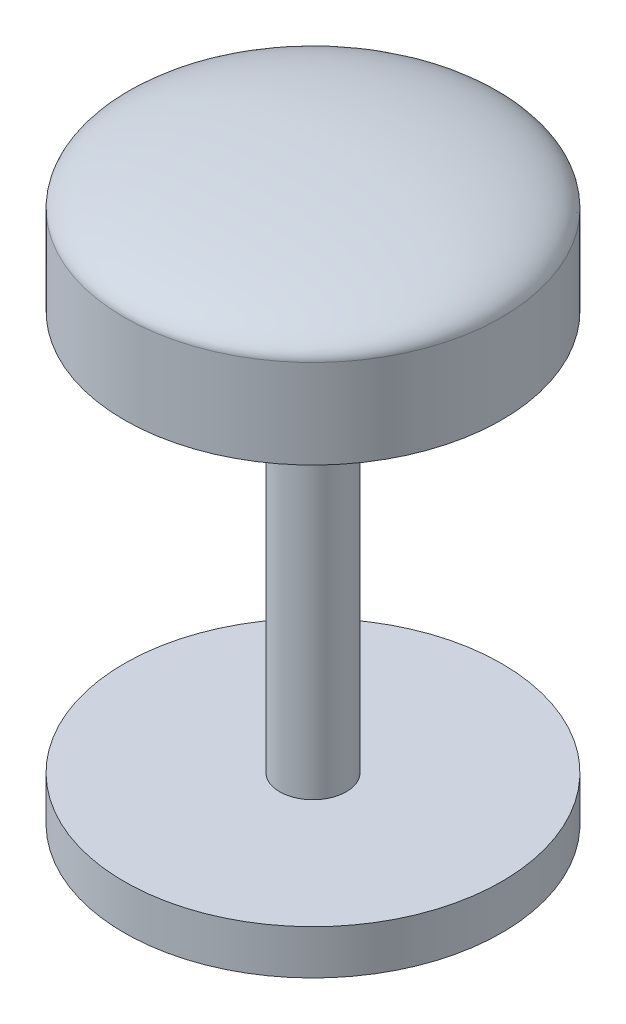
ISO-10303-21;
HEADER;
FILE_DESCRIPTION(('STEP AP214'),'2;1');
FILE_NAME('part.step','',(''),(''),'','','');
FILE_SCHEMA(('AUTOMOTIVE_DESIGN { 1 0 10303 214 1 1 1 1 }'));
ENDSEC;
DATA;
#1=APPLICATION_CONTEXT('core data for automotive mechanical design processes');
#2=APPLICATION_PROTOCOL_DEFINITION('international standard','automotive_design',2000,#1);
#3=PRODUCT_CONTEXT('',#1,'mechanical');
#4=PRODUCT('Part','Part','',(#3));
#5=PRODUCT_RELATED_PRODUCT_CATEGORY('part','',(#4));
#6=PRODUCT_DEFINITION_FORMATION('','',#4);
#7=PRODUCT_DEFINITION_CONTEXT('part definition',#1,'design');
#8=PRODUCT_DEFINITION('design','',#6,#7);
#9=PRODUCT_DEFINITION_SHAPE('','',#8);
#10=(LENGTH_UNIT() NAMED_UNIT(*) SI_UNIT(.MILLI.,.METRE.));
#11=(NAMED_UNIT(*) PLANE_ANGLE_UNIT() SI_UNIT($,.RADIAN.));
#12=(NAMED_UNIT(*) SI_UNIT($,.STERADIAN.) SOLID_ANGLE_UNIT());
#13=UNCERTAINTY_MEASURE_WITH_UNIT(LENGTH_MEASURE(1.E-05),#10,'distance_accuracy_value','');
#14=(GEOMETRIC_REPRESENTATION_CONTEXT(3) GLOBAL_UNCERTAINTY_ASSIGNED_CONTEXT((#13)) GLOBAL_UNIT_ASSIGNED_CONTEXT((#10,
#11,#12)) REPRESENTATION_CONTEXT('',''));
#15=CARTESIAN_POINT('',(0.,0.,0.));
#16=DIRECTION('',(0.,0.,1.));
#17=DIRECTION('',(1.,0.,0.));
#18=AXIS2_PLACEMENT_3D('',#15,#16,#17);
#19=CARTESIAN_POINT('',(0.,-4.24264068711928,0.));
#20=DIRECTION('',(0.,1.,0.));
#21=DIRECTION('',(0.,0.,1.));
#22=AXIS2_PLACEMENT_3D('',#19,#20,#21);
#23=CYLINDRICAL_SURFACE('',#22,1.5);
#24=CARTESIAN_POINT('',(0.,20.,0.));
#25=DIRECTION('',(0.,1.,0.));
#26=DIRECTION('',(0.,0.,1.));
#27=AXIS2_PLACEMENT_3D('',#24,#25,#26);
#28=CIRCLE('',#27,1.5);
#29=CARTESIAN_POINT('',(0.,20.,1.5));
#30=VERTEX_POINT('',#29);
#31=EDGE_CURVE('E64',#30,#30,#28,.T.);
#32=ORIENTED_EDGE('',*,*,#31,.F.);
#33=EDGE_LOOP('',(#32));
#34=FACE_BOUND('',#33,.T.);
#35=CARTESIAN_POINT('',(0.,2.,0.));
#36=DIRECTION('',(0.,-1.,0.));
#37=DIRECTION('',(0.,0.,-1.));
#38=AXIS2_PLACEMENT_3D('',#35,#36,#37);
#39=CIRCLE('',#38,1.5);
#40=CARTESIAN_POINT('',(0.,2.,-1.5));
#41=VERTEX_POINT('',#40);
#42=EDGE_CURVE('E46',#41,#41,#39,.F.);
#43=ORIENTED_EDGE('',*,*,#42,.T.);
#44=EDGE_LOOP('',(#43));
#45=FACE_BOUND('',#44,.T.);
#46=ADVANCED_FACE('F41',(#34,#45),#23,.T.);
#47=CARTESIAN_POINT('',(0.,24.,0.));
#48=DIRECTION('',(0.,-1.,0.));
#49=DIRECTION('',(0.,0.,-1.));
#50=AXIS2_PLACEMENT_3D('',#47,#48,#49);
#51=CYLINDRICAL_SURFACE('',#50,8.5);
#52=CARTESIAN_POINT('',(0.,24.,0.));
#53=DIRECTION('',(0.,1.,0.));
#54=DIRECTION('',(0.,0.,1.));
#55=AXIS2_PLACEMENT_3D('',#52,#53,#54);
#56=CIRCLE('',#55,8.5);
#57=CARTESIAN_POINT('',(0.,24.,8.5));
#58=VERTEX_POINT('',#57);
#59=EDGE_CURVE('E11',#58,#58,#56,.T.);
#60=ORIENTED_EDGE('',*,*,#59,.F.);
#61=EDGE_LOOP('',(#60));
#62=FACE_BOUND('',#61,.T.);
#63=CARTESIAN_POINT('',(0.,20.,0.));
#64=DIRECTION('',(0.,1.,0.));
#65=DIRECTION('',(0.,0.,1.));
#66=AXIS2_PLACEMENT_3D('',#63,#64,#65);
#67=CIRCLE('',#66,8.5);
#68=CARTESIAN_POINT('',(0.,20.,8.5));
#69=VERTEX_POINT('',#68);
#70=EDGE_CURVE('E49',#69,#69,#67,.T.);
#71=ORIENTED_EDGE('',*,*,#70,.T.);
#72=EDGE_LOOP('',(#71));
#73=FACE_BOUND('',#72,.T.);
#74=ADVANCED_FACE('F56',(#62,#73),#51,.T.);
#75=CARTESIAN_POINT('',(0.,24.,0.));
#76=DIRECTION('',(1.,0.,0.));
#77=DIRECTION('',(0.,0.,1.));
#78=AXIS2_PLACEMENT_3D('',#75,#76,#77);
#79=ELLIPSE('',#78,8.5,2.);
#80=TRIMMED_CURVE('',#79,(PARAMETER_VALUE(4.71238898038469)),
(PARAMETER_VALUE(7.85398163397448)),.T.,.PARAMETER.);
#81=CARTESIAN_POINT('',(0.,22.,0.));
#82=DIRECTION('',(0.,1.,0.));
#83=AXIS1_PLACEMENT('',#81,#82);
#84=SURFACE_OF_REVOLUTION('',#80,#83);
#85=CARTESIAN_POINT('',(0.,26.,0.));
#86=VERTEX_POINT('',#85);
#87=VERTEX_LOOP('',#86);
#88=FACE_BOUND('',#87,.T.);
#89=ORIENTED_EDGE('',*,*,#59,.T.);
#90=EDGE_LOOP('',(#89));
#91=FACE_BOUND('',#90,.T.);
#92=ADVANCED_FACE('F43',(#88,#91),#84,.F.);
#93=CARTESIAN_POINT('',(0.,20.,0.));
#94=DIRECTION('',(0.,1.,0.));
#95=DIRECTION('',(0.,0.,1.));
#96=AXIS2_PLACEMENT_3D('',#93,#94,#95);
#97=PLANE('',#96);
#98=ORIENTED_EDGE('',*,*,#31,.T.);
#99=EDGE_LOOP('',(#98));
#100=FACE_BOUND('',#99,.T.);
#101=ORIENTED_EDGE('',*,*,#70,.F.);
#102=EDGE_LOOP('',(#101));
#103=FACE_BOUND('',#102,.T.);
#104=ADVANCED_FACE('F55',(#100,#103),#97,.F.);
#105=CARTESIAN_POINT('',(0.,2.,0.));
#106=DIRECTION('',(0.,-1.,0.));
#107=DIRECTION('',(0.,0.,-1.));
#108=AXIS2_PLACEMENT_3D('',#105,#106,#107);
#109=CYLINDRICAL_SURFACE('',#108,8.5);
#110=CARTESIAN_POINT('',(0.,2.,0.));
#111=DIRECTION('',(0.,-1.,0.));
#112=DIRECTION('',(0.,0.,-1.));
#113=AXIS2_PLACEMENT_3D('',#110,#111,#112);
#114=CIRCLE('',#113,8.5);
#115=CARTESIAN_POINT('',(0.,2.,-8.5));
#116=VERTEX_POINT('',#115);
#117=EDGE_CURVE('E73',#116,#116,#114,.T.);
#118=ORIENTED_EDGE('',*,*,#117,.T.);
#119=EDGE_LOOP('',(#118));
#120=FACE_BOUND('',#119,.T.);
#121=CARTESIAN_POINT('',(0.,0.,0.));
#122=DIRECTION('',(0.,-1.,0.));
#123=DIRECTION('',(0.,0.,-1.));
#124=AXIS2_PLACEMENT_3D('',#121,#122,#123);
#125=CIRCLE('',#124,8.5);
#126=CARTESIAN_POINT('',(0.,0.,-8.5));
#127=VERTEX_POINT('',#126);
#128=EDGE_CURVE('E70',#127,#127,#125,.T.);
#129=ORIENTED_EDGE('',*,*,#128,.F.);
#130=EDGE_LOOP('',(#129));
#131=FACE_BOUND('',#130,.T.);
#132=ADVANCED_FACE('F85',(#120,#131),#109,.T.);
#133=CARTESIAN_POINT('',(0.,2.,0.));
#134=DIRECTION('',(0.,-1.,0.));
#135=DIRECTION('',(0.,0.,-1.));
#136=AXIS2_PLACEMENT_3D('',#133,#134,#135);
#137=PLANE('',#136);
#138=ORIENTED_EDGE('',*,*,#42,.F.);
#139=EDGE_LOOP('',(#138));
#140=FACE_BOUND('',#139,.T.);
#141=ORIENTED_EDGE('',*,*,#117,.F.);
#142=EDGE_LOOP('',(#141));
#143=FACE_BOUND('',#142,.T.);
#144=ADVANCED_FACE('F81',(#140,#143),#137,.F.);
#145=CARTESIAN_POINT('',(0.,0.,0.));
#146=DIRECTION('',(0.,1.,0.));
#147=DIRECTION('',(0.,0.,1.));
#148=AXIS2_PLACEMENT_3D('',#145,#146,#147);
#149=PLANE('',#148);
#150=ORIENTED_EDGE('',*,*,#128,.T.);
#151=EDGE_LOOP('',(#150));
#152=FACE_BOUND('',#151,.T.);
#153=ADVANCED_FACE('F84',(#152),#149,.F.);
#154=CLOSED_SHELL('',(#46,#74,#92,#104,#132,#144,#153));
#155=MANIFOLD_SOLID_BREP('B2',#154);
#156=ADVANCED_BREP_SHAPE_REPRESENTATION('',(#18,#155),#14);
#157=SHAPE_DEFINITION_REPRESENTATION(#9,#156);
ENDSEC;
END-ISO-10303-21;
